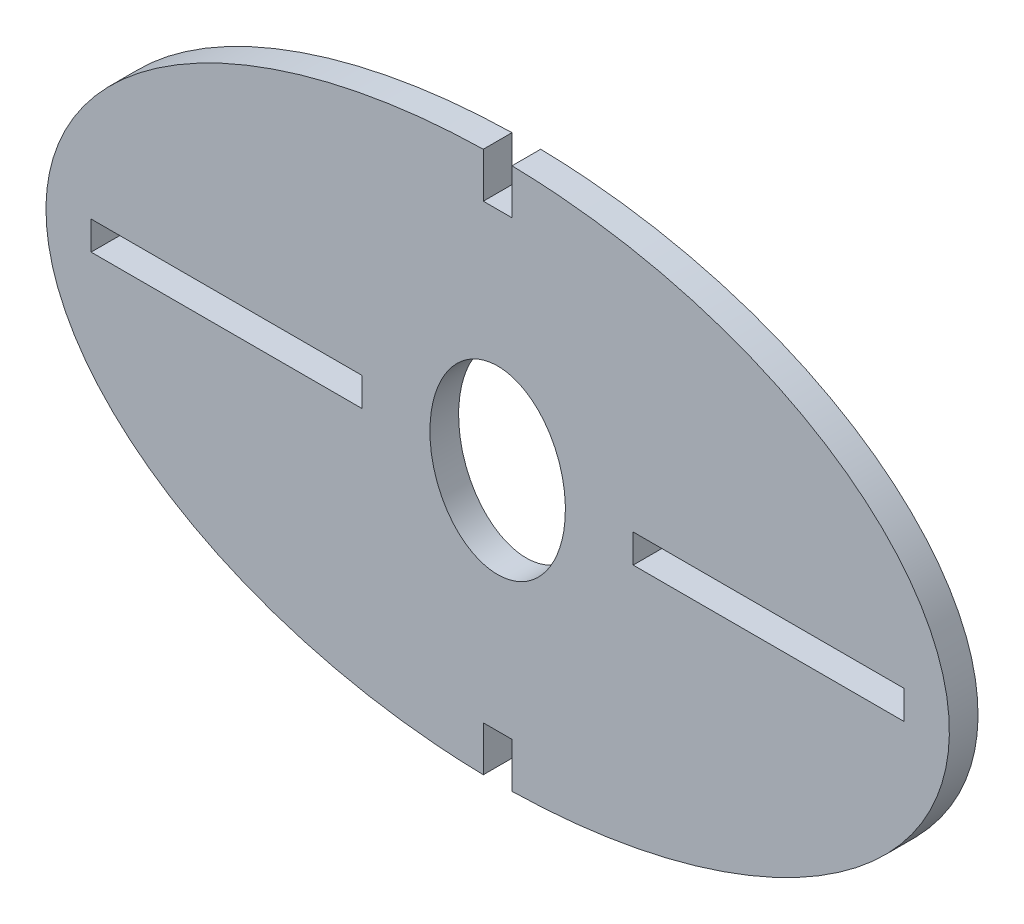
from build123d import *

# Parameters (mm, degrees)
SKETCH1_RX          = 50
SKETCH1_RY          = 30
SKETCH1_RX_2        = 10
SKETCH1_RY_2        = 7.5
SKETCH1_W           = 30
SKETCH1_H           = 3.175
BOSS_EXTRUDE1_DEPTH = 3.175
CUT_EXTRUDE1_DEPTH  = 10


with BuildPart() as part:
    # Sketch1 → Boss-Extrude1 (new body)
    with BuildSketch(Plane.XY):
        with Locations(Location((0, 0), (0, 0, 180))):
            Ellipse(SKETCH1_RX, SKETCH1_RY)
        with Locations(Location((0, 0), (0, 0, -90))):
            Ellipse(SKETCH1_RX_2, SKETCH1_RY_2, mode=Mode.SUBTRACT)
        with Locations((-30, 0)):
            Rectangle(SKETCH1_W, SKETCH1_H, mode=Mode.SUBTRACT)
        with Locations((30, 0)):
            Rectangle(SKETCH1_W, SKETCH1_H, mode=Mode.SUBTRACT)
    extrude(amount=BOSS_EXTRUDE1_DEPTH)

    # Sketch2 → Cut-Extrude1 (cut)
    with BuildSketch(Plane.XY.offset(3.175)):
        Polygon((0, 25), (-1.5875, 25), (-1.5875, 47.453534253), (1.5875, 47.453534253), (1.5875, 25), align=None)
        Polygon((-1.5875, -47.453534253), (1.5875, -47.453534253), (1.5875, -25), (0, -25), (-1.5875, -25), align=None)
    extrude(amount=-CUT_EXTRUDE1_DEPTH, mode=Mode.SUBTRACT)


solid = part.part
